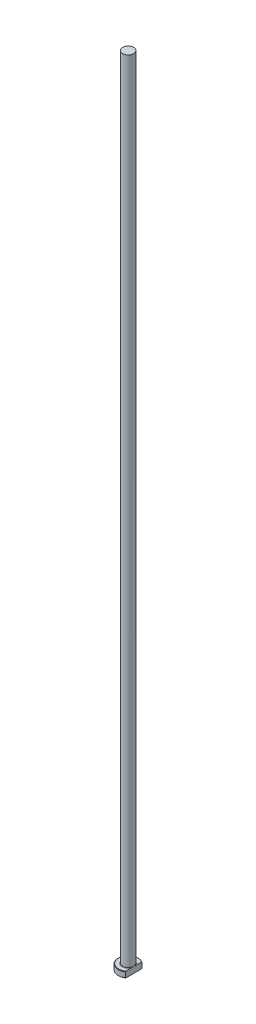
from build123d import *
from build123d.topology import SkipClean

# Parameters (mm, degrees)
CHAMFER1_SIZE = 0.2
FILLET1_R     = 0.2
KEY_DEPTH     = 401.062495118


with BuildPart() as part:
    # Sketch1 → Revolve1 (revolve)
    with BuildSketch(Plane.XY, mode=Mode.PRIVATE) as revolve1_sk:
        Polygon((0, 0), (-5, 0), (-5, 3), (-2.75, 3), (-2.75, 400), (0, 400), align=None)
    revolve(revolve1_sk.sketch.rotate(Axis((0, 259.958771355, 0), (0, -1, 0)), 270), axis=Axis((0, 259.958771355, 0), (0, -1, 0)))

    # Chamfer1
    chamfer1_edges = [part.edges().sort_by_distance(p)[0] for p in [
        (0, 3, -5),
        (0, 0, -5),
    ]]
    chamfer(chamfer1_edges, length=CHAMFER1_SIZE)

    # Fillet1
    fillet1_edges = [part.edges().sort_by_distance(p)[0] for p in [
        (0, 3, -2.75),
    ]]
    fillet(fillet1_edges, radius=FILLET1_R)

    # Sketch2 → KEY (cut, through all)
    with SkipClean():  # the faces are left unmerged after this step: merging them gives an invalid solid
        with BuildSketch(Plane(origin=(0, 0, 0), x_dir=(1, 0, 0), z_dir=(0, 1, 0))):
            with BuildLine():
                Line((2.75, 4.175823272), (2.75, -4.175823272))
                ThreePointArc((2.75, -4.175823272), (5, 0), (2.75, 4.175823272))
            make_face()
        extrude(amount=KEY_DEPTH, mode=Mode.SUBTRACT)


solid = part.part
